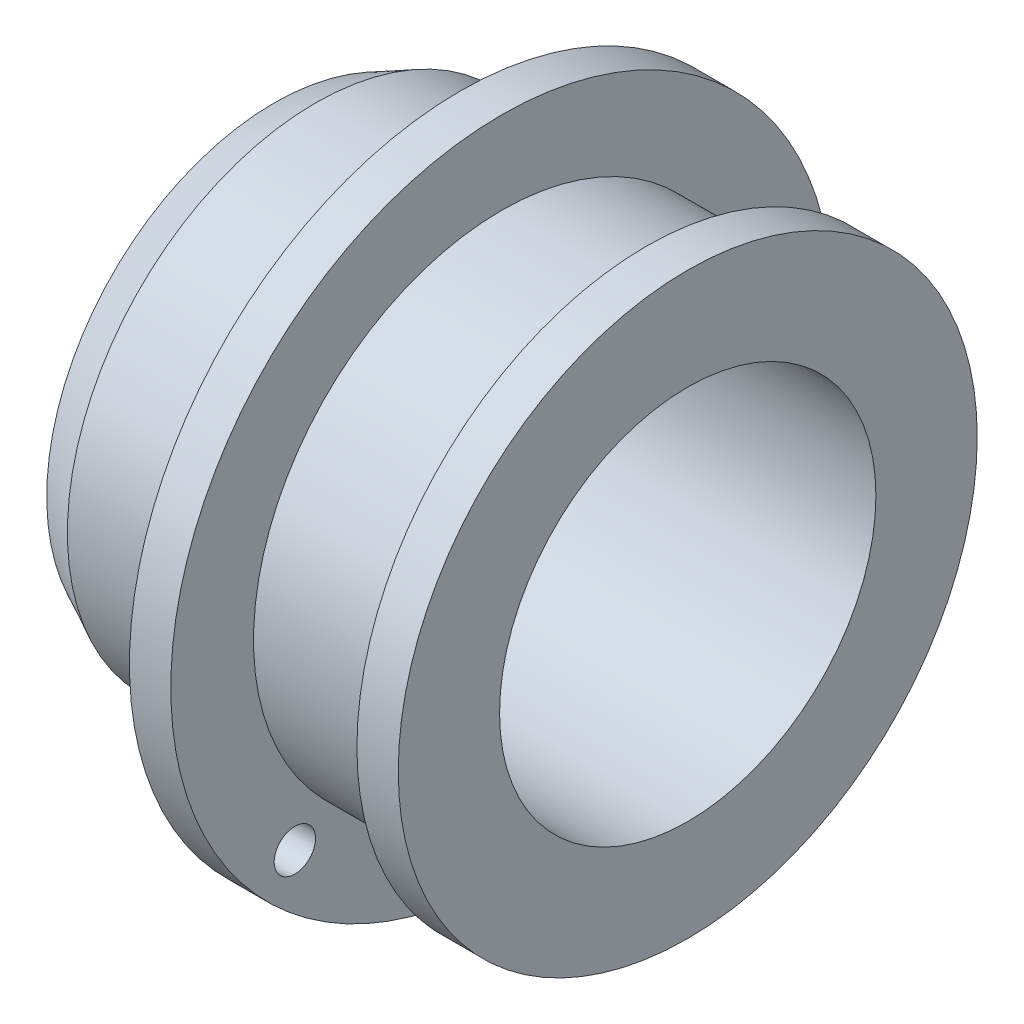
ISO-10303-21;
HEADER;
FILE_DESCRIPTION(('STEP AP214'),'2;1');
FILE_NAME('part.step','',(''),(''),'','','');
FILE_SCHEMA(('AUTOMOTIVE_DESIGN { 1 0 10303 214 1 1 1 1 }'));
ENDSEC;
DATA;
#1=APPLICATION_CONTEXT('core data for automotive mechanical design processes');
#2=APPLICATION_PROTOCOL_DEFINITION('international standard','automotive_design',2000,#1);
#3=PRODUCT_CONTEXT('',#1,'mechanical');
#4=PRODUCT('Part','Part','',(#3));
#5=PRODUCT_RELATED_PRODUCT_CATEGORY('part','',(#4));
#6=PRODUCT_DEFINITION_FORMATION('','',#4);
#7=PRODUCT_DEFINITION_CONTEXT('part definition',#1,'design');
#8=PRODUCT_DEFINITION('design','',#6,#7);
#9=PRODUCT_DEFINITION_SHAPE('','',#8);
#10=(LENGTH_UNIT() NAMED_UNIT(*) SI_UNIT(.MILLI.,.METRE.));
#11=(NAMED_UNIT(*) PLANE_ANGLE_UNIT() SI_UNIT($,.RADIAN.));
#12=(NAMED_UNIT(*) SI_UNIT($,.STERADIAN.) SOLID_ANGLE_UNIT());
#13=UNCERTAINTY_MEASURE_WITH_UNIT(LENGTH_MEASURE(1.E-05),#10,'distance_accuracy_value','');
#14=(GEOMETRIC_REPRESENTATION_CONTEXT(3) GLOBAL_UNCERTAINTY_ASSIGNED_CONTEXT((#13)) GLOBAL_UNIT_ASSIGNED_CONTEXT((#10,
#11,#12)) REPRESENTATION_CONTEXT('',''));
#15=CARTESIAN_POINT('',(0.,0.,0.));
#16=DIRECTION('',(0.,0.,1.));
#17=DIRECTION('',(1.,0.,0.));
#18=AXIS2_PLACEMENT_3D('',#15,#16,#17);
#19=CARTESIAN_POINT('',(0.,0.,0.));
#20=DIRECTION('',(-1.,0.,0.));
#21=DIRECTION('',(0.,-1.,0.));
#22=AXIS2_PLACEMENT_3D('',#19,#20,#21);
#23=PLANE('',#22);
#24=CARTESIAN_POINT('',(0.,0.,0.));
#25=DIRECTION('',(-1.,0.,0.));
#26=DIRECTION('',(0.,-1.,0.));
#27=AXIS2_PLACEMENT_3D('',#24,#25,#26);
#28=CIRCLE('',#27,57.785);
#29=CARTESIAN_POINT('',(0.,-57.785,0.));
#30=VERTEX_POINT('',#29);
#31=EDGE_CURVE('E80',#30,#30,#28,.T.);
#32=ORIENTED_EDGE('',*,*,#31,.F.);
#33=EDGE_LOOP('',(#32));
#34=FACE_BOUND('',#33,.T.);
#35=CARTESIAN_POINT('',(0.,0.,0.));
#36=DIRECTION('',(1.,0.,0.));
#37=DIRECTION('',(0.,1.,0.));
#38=AXIS2_PLACEMENT_3D('',#35,#36,#37);
#39=CIRCLE('',#38,69.85);
#40=CARTESIAN_POINT('',(0.,69.85,0.));
#41=VERTEX_POINT('',#40);
#42=EDGE_CURVE('E10',#41,#41,#39,.T.);
#43=ORIENTED_EDGE('',*,*,#42,.F.);
#44=EDGE_LOOP('',(#43));
#45=FACE_BOUND('',#44,.T.);
#46=ADVANCED_FACE('F34',(#34,#45),#23,.T.);
#47=CARTESIAN_POINT('',(12.7,0.,0.));
#48=DIRECTION('',(1.,0.,0.));
#49=DIRECTION('',(0.,1.,0.));
#50=AXIS2_PLACEMENT_3D('',#47,#48,#49);
#51=CONICAL_SURFACE('',#50,76.2,0.463647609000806);
#52=ORIENTED_EDGE('',*,*,#42,.T.);
#53=EDGE_LOOP('',(#52));
#54=FACE_BOUND('',#53,.T.);
#55=CARTESIAN_POINT('',(12.7,0.,0.));
#56=DIRECTION('',(1.,0.,0.));
#57=DIRECTION('',(0.,1.,0.));
#58=AXIS2_PLACEMENT_3D('',#55,#56,#57);
#59=CIRCLE('',#58,76.2);
#60=CARTESIAN_POINT('',(12.7,76.2,0.));
#61=VERTEX_POINT('',#60);
#62=EDGE_CURVE('E41',#61,#61,#59,.T.);
#63=ORIENTED_EDGE('',*,*,#62,.F.);
#64=EDGE_LOOP('',(#63));
#65=FACE_BOUND('',#64,.T.);
#66=ADVANCED_FACE('F108',(#54,#65),#51,.T.);
#67=CARTESIAN_POINT('',(127.,0.,0.));
#68=DIRECTION('',(1.,0.,0.));
#69=DIRECTION('',(0.,1.,0.));
#70=AXIS2_PLACEMENT_3D('',#67,#68,#69);
#71=CYLINDRICAL_SURFACE('',#70,76.2);
#72=ORIENTED_EDGE('',*,*,#62,.T.);
#73=EDGE_LOOP('',(#72));
#74=FACE_BOUND('',#73,.T.);
#75=CARTESIAN_POINT('',(57.15,0.,0.));
#76=DIRECTION('',(1.,0.,0.));
#77=DIRECTION('',(0.,1.,0.));
#78=AXIS2_PLACEMENT_3D('',#75,#76,#77);
#79=CIRCLE('',#78,76.2);
#80=CARTESIAN_POINT('',(57.15,76.2,0.));
#81=VERTEX_POINT('',#80);
#82=EDGE_CURVE('E45',#81,#81,#79,.T.);
#83=ORIENTED_EDGE('',*,*,#82,.F.);
#84=EDGE_LOOP('',(#83));
#85=FACE_BOUND('',#84,.T.);
#86=ADVANCED_FACE('F113',(#74,#85),#71,.T.);
#87=CARTESIAN_POINT('',(57.15,76.2,0.));
#88=DIRECTION('',(-1.,0.,0.));
#89=DIRECTION('',(0.,-1.,0.));
#90=AXIS2_PLACEMENT_3D('',#87,#88,#89);
#91=PLANE('',#90);
#92=CARTESIAN_POINT('',(57.15,-62.2170394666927,63.5));
#93=DIRECTION('',(-1.,0.,0.));
#94=DIRECTION('',(0.,-1.,0.));
#95=AXIS2_PLACEMENT_3D('',#92,#93,#94);
#96=CIRCLE('',#95,6.35);
#97=CARTESIAN_POINT('',(57.15,-55.8670394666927,63.5));
#98=VERTEX_POINT('',#97);
#99=EDGE_CURVE('E68',#98,#98,#96,.T.);
#100=ORIENTED_EDGE('',*,*,#99,.F.);
#101=EDGE_LOOP('',(#100));
#102=FACE_BOUND('',#101,.T.);
#103=CARTESIAN_POINT('',(57.15,-62.2170394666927,-63.5));
#104=DIRECTION('',(-1.,0.,0.));
#105=DIRECTION('',(0.,-1.,0.));
#106=AXIS2_PLACEMENT_3D('',#103,#104,#105);
#107=CIRCLE('',#106,6.35000000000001);
#108=CARTESIAN_POINT('',(57.15,-55.8670394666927,-63.5));
#109=VERTEX_POINT('',#108);
#110=EDGE_CURVE('E71',#109,#109,#107,.T.);
#111=ORIENTED_EDGE('',*,*,#110,.F.);
#112=EDGE_LOOP('',(#111));
#113=FACE_BOUND('',#112,.T.);
#114=ORIENTED_EDGE('',*,*,#82,.T.);
#115=EDGE_LOOP('',(#114));
#116=FACE_BOUND('',#115,.T.);
#117=CARTESIAN_POINT('',(57.15,0.,0.));
#118=DIRECTION('',(1.,0.,0.));
#119=DIRECTION('',(0.,1.,0.));
#120=AXIS2_PLACEMENT_3D('',#117,#118,#119);
#121=CIRCLE('',#120,101.6);
#122=CARTESIAN_POINT('',(57.15,101.6,0.));
#123=VERTEX_POINT('',#122);
#124=EDGE_CURVE('E50',#123,#123,#121,.T.);
#125=ORIENTED_EDGE('',*,*,#124,.F.);
#126=EDGE_LOOP('',(#125));
#127=FACE_BOUND('',#126,.T.);
#128=ADVANCED_FACE('F118',(#102,#113,#116,#127),#91,.T.);
#129=CARTESIAN_POINT('',(127.,0.,0.));
#130=DIRECTION('',(1.,0.,0.));
#131=DIRECTION('',(0.,1.,0.));
#132=AXIS2_PLACEMENT_3D('',#129,#130,#131);
#133=CYLINDRICAL_SURFACE('',#132,101.6);
#134=ORIENTED_EDGE('',*,*,#124,.T.);
#135=EDGE_LOOP('',(#134));
#136=FACE_BOUND('',#135,.T.);
#137=CARTESIAN_POINT('',(69.85,0.,0.));
#138=DIRECTION('',(1.,0.,0.));
#139=DIRECTION('',(0.,1.,0.));
#140=AXIS2_PLACEMENT_3D('',#137,#138,#139);
#141=CIRCLE('',#140,101.6);
#142=CARTESIAN_POINT('',(69.85,101.6,0.));
#143=VERTEX_POINT('',#142);
#144=EDGE_CURVE('E53',#143,#143,#141,.T.);
#145=ORIENTED_EDGE('',*,*,#144,.F.);
#146=EDGE_LOOP('',(#145));
#147=FACE_BOUND('',#146,.T.);
#148=ADVANCED_FACE('F125',(#136,#147),#133,.T.);
#149=CARTESIAN_POINT('',(69.85,101.6,0.));
#150=DIRECTION('',(1.,0.,0.));
#151=DIRECTION('',(0.,1.,0.));
#152=AXIS2_PLACEMENT_3D('',#149,#150,#151);
#153=PLANE('',#152);
#154=CARTESIAN_POINT('',(69.85,-62.2170394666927,63.5));
#155=DIRECTION('',(1.,0.,0.));
#156=DIRECTION('',(0.,1.,0.));
#157=AXIS2_PLACEMENT_3D('',#154,#155,#156);
#158=CIRCLE('',#157,6.35);
#159=CARTESIAN_POINT('',(69.85,-55.8670394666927,63.5));
#160=VERTEX_POINT('',#159);
#161=EDGE_CURVE('E74',#160,#160,#158,.T.);
#162=ORIENTED_EDGE('',*,*,#161,.F.);
#163=EDGE_LOOP('',(#162));
#164=FACE_BOUND('',#163,.T.);
#165=CARTESIAN_POINT('',(69.85,-62.2170394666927,-63.5));
#166=DIRECTION('',(1.,0.,0.));
#167=DIRECTION('',(0.,1.,0.));
#168=AXIS2_PLACEMENT_3D('',#165,#166,#167);
#169=CIRCLE('',#168,6.35000000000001);
#170=CARTESIAN_POINT('',(69.85,-55.8670394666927,-63.5));
#171=VERTEX_POINT('',#170);
#172=EDGE_CURVE('E75',#171,#171,#169,.T.);
#173=ORIENTED_EDGE('',*,*,#172,.F.);
#174=EDGE_LOOP('',(#173));
#175=FACE_BOUND('',#174,.T.);
#176=ORIENTED_EDGE('',*,*,#144,.T.);
#177=EDGE_LOOP('',(#176));
#178=FACE_BOUND('',#177,.T.);
#179=CARTESIAN_POINT('',(69.85,0.,0.));
#180=DIRECTION('',(1.,0.,0.));
#181=DIRECTION('',(0.,1.,0.));
#182=AXIS2_PLACEMENT_3D('',#179,#180,#181);
#183=CIRCLE('',#182,76.2);
#184=CARTESIAN_POINT('',(69.85,76.2,0.));
#185=VERTEX_POINT('',#184);
#186=EDGE_CURVE('E56',#185,#185,#183,.T.);
#187=ORIENTED_EDGE('',*,*,#186,.F.);
#188=EDGE_LOOP('',(#187));
#189=FACE_BOUND('',#188,.T.);
#190=ADVANCED_FACE('F129',(#164,#175,#178,#189),#153,.T.);
#191=CARTESIAN_POINT('',(127.,0.,0.));
#192=DIRECTION('',(1.,0.,0.));
#193=DIRECTION('',(0.,1.,0.));
#194=AXIS2_PLACEMENT_3D('',#191,#192,#193);
#195=CYLINDRICAL_SURFACE('',#194,76.2);
#196=ORIENTED_EDGE('',*,*,#186,.T.);
#197=EDGE_LOOP('',(#196));
#198=FACE_BOUND('',#197,.T.);
#199=CARTESIAN_POINT('',(114.3,0.,0.));
#200=DIRECTION('',(1.,0.,0.));
#201=DIRECTION('',(0.,1.,0.));
#202=AXIS2_PLACEMENT_3D('',#199,#200,#201);
#203=CIRCLE('',#202,76.2);
#204=CARTESIAN_POINT('',(114.3,76.2,0.));
#205=VERTEX_POINT('',#204);
#206=EDGE_CURVE('E59',#205,#205,#203,.T.);
#207=ORIENTED_EDGE('',*,*,#206,.F.);
#208=EDGE_LOOP('',(#207));
#209=FACE_BOUND('',#208,.T.);
#210=ADVANCED_FACE('F104',(#198,#209),#195,.T.);
#211=CARTESIAN_POINT('',(114.3,76.2,0.));
#212=DIRECTION('',(-1.,0.,0.));
#213=DIRECTION('',(0.,-1.,0.));
#214=AXIS2_PLACEMENT_3D('',#211,#212,#213);
#215=PLANE('',#214);
#216=ORIENTED_EDGE('',*,*,#206,.T.);
#217=EDGE_LOOP('',(#216));
#218=FACE_BOUND('',#217,.T.);
#219=CARTESIAN_POINT('',(114.3,0.,0.));
#220=DIRECTION('',(1.,0.,0.));
#221=DIRECTION('',(0.,1.,0.));
#222=AXIS2_PLACEMENT_3D('',#219,#220,#221);
#223=CIRCLE('',#222,88.9);
#224=CARTESIAN_POINT('',(114.3,88.9,0.));
#225=VERTEX_POINT('',#224);
#226=EDGE_CURVE('E62',#225,#225,#223,.T.);
#227=ORIENTED_EDGE('',*,*,#226,.F.);
#228=EDGE_LOOP('',(#227));
#229=FACE_BOUND('',#228,.T.);
#230=ADVANCED_FACE('F98',(#218,#229),#215,.T.);
#231=CARTESIAN_POINT('',(127.,0.,0.));
#232=DIRECTION('',(1.,0.,0.));
#233=DIRECTION('',(0.,1.,0.));
#234=AXIS2_PLACEMENT_3D('',#231,#232,#233);
#235=CYLINDRICAL_SURFACE('',#234,88.9);
#236=ORIENTED_EDGE('',*,*,#226,.T.);
#237=EDGE_LOOP('',(#236));
#238=FACE_BOUND('',#237,.T.);
#239=CARTESIAN_POINT('',(127.,0.,0.));
#240=DIRECTION('',(1.,0.,0.));
#241=DIRECTION('',(0.,1.,0.));
#242=AXIS2_PLACEMENT_3D('',#239,#240,#241);
#243=CIRCLE('',#242,88.9);
#244=CARTESIAN_POINT('',(127.,88.9,0.));
#245=VERTEX_POINT('',#244);
#246=EDGE_CURVE('E65',#245,#245,#243,.T.);
#247=ORIENTED_EDGE('',*,*,#246,.F.);
#248=EDGE_LOOP('',(#247));
#249=FACE_BOUND('',#248,.T.);
#250=ADVANCED_FACE('F93',(#238,#249),#235,.T.);
#251=CARTESIAN_POINT('',(127.,88.9,0.));
#252=DIRECTION('',(1.,0.,0.));
#253=DIRECTION('',(0.,1.,0.));
#254=AXIS2_PLACEMENT_3D('',#251,#252,#253);
#255=PLANE('',#254);
#256=CARTESIAN_POINT('',(127.,0.,0.));
#257=DIRECTION('',(1.,0.,0.));
#258=DIRECTION('',(0.,1.,0.));
#259=AXIS2_PLACEMENT_3D('',#256,#257,#258);
#260=CIRCLE('',#259,57.785);
#261=CARTESIAN_POINT('',(127.,57.785,0.));
#262=VERTEX_POINT('',#261);
#263=EDGE_CURVE('E37',#262,#262,#260,.T.);
#264=ORIENTED_EDGE('',*,*,#263,.F.);
#265=EDGE_LOOP('',(#264));
#266=FACE_BOUND('',#265,.T.);
#267=ORIENTED_EDGE('',*,*,#246,.T.);
#268=EDGE_LOOP('',(#267));
#269=FACE_BOUND('',#268,.T.);
#270=ADVANCED_FACE('F89',(#266,#269),#255,.T.);
#271=CARTESIAN_POINT('',(-6.34999999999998,-62.2170394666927,-63.5));
#272=DIRECTION('',(1.,0.,0.));
#273=DIRECTION('',(0.,1.,0.));
#274=AXIS2_PLACEMENT_3D('',#271,#272,#273);
#275=CYLINDRICAL_SURFACE('',#274,6.35000000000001);
#276=CARTESIAN_POINT('',(57.15,-55.8670394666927,-63.5));
#277=CARTESIAN_POINT('',(57.2822916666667,-55.8670394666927,-63.5));
#278=CARTESIAN_POINT('',(57.4145833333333,-55.8670394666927,-63.5));
#279=CARTESIAN_POINT('',(57.6791666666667,-55.8670394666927,-63.5));
#280=CARTESIAN_POINT('',(57.8114583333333,-55.8670394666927,-63.5));
#281=CARTESIAN_POINT('',(58.0760416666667,-55.8670394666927,-63.5));
#282=CARTESIAN_POINT('',(58.2083333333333,-55.8670394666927,-63.5));
#283=CARTESIAN_POINT('',(58.4729166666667,-55.8670394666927,-63.5));
#284=CARTESIAN_POINT('',(58.6052083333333,-55.8670394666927,-63.5));
#285=CARTESIAN_POINT('',(58.8697916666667,-55.8670394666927,-63.5));
#286=CARTESIAN_POINT('',(59.0020833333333,-55.8670394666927,-63.5));
#287=CARTESIAN_POINT('',(59.2666666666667,-55.8670394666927,-63.5));
#288=CARTESIAN_POINT('',(59.3989583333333,-55.8670394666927,-63.5));
#289=CARTESIAN_POINT('',(59.6635416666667,-55.8670394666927,-63.5));
#290=CARTESIAN_POINT('',(59.7958333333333,-55.8670394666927,-63.5));
#291=CARTESIAN_POINT('',(60.0604166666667,-55.8670394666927,-63.5));
#292=CARTESIAN_POINT('',(60.1927083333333,-55.8670394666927,-63.5));
#293=CARTESIAN_POINT('',(60.4572916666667,-55.8670394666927,-63.5));
#294=CARTESIAN_POINT('',(60.5895833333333,-55.8670394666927,-63.5));
#295=CARTESIAN_POINT('',(60.8541666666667,-55.8670394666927,-63.5));
#296=CARTESIAN_POINT('',(60.9864583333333,-55.8670394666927,-63.5));
#297=CARTESIAN_POINT('',(61.2510416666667,-55.8670394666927,-63.5));
#298=CARTESIAN_POINT('',(61.3833333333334,-55.8670394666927,-63.5));
#299=CARTESIAN_POINT('',(61.6479166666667,-55.8670394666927,-63.5));
#300=CARTESIAN_POINT('',(61.7802083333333,-55.8670394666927,-63.5));
#301=CARTESIAN_POINT('',(62.0447916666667,-55.8670394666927,-63.5));
#302=CARTESIAN_POINT('',(62.1770833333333,-55.8670394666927,-63.5));
#303=CARTESIAN_POINT('',(62.4416666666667,-55.8670394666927,-63.5));
#304=CARTESIAN_POINT('',(62.5739583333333,-55.8670394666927,-63.5));
#305=CARTESIAN_POINT('',(62.8385416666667,-55.8670394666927,-63.5));
#306=CARTESIAN_POINT('',(62.9708333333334,-55.8670394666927,-63.5));
#307=CARTESIAN_POINT('',(63.2354166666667,-55.8670394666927,-63.5));
#308=CARTESIAN_POINT('',(63.3677083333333,-55.8670394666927,-63.5));
#309=CARTESIAN_POINT('',(63.6322916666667,-55.8670394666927,-63.5));
#310=CARTESIAN_POINT('',(63.7645833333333,-55.8670394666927,-63.5));
#311=CARTESIAN_POINT('',(64.0291666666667,-55.8670394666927,-63.5));
#312=CARTESIAN_POINT('',(64.1614583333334,-55.8670394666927,-63.5));
#313=CARTESIAN_POINT('',(64.4260416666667,-55.8670394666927,-63.5));
#314=CARTESIAN_POINT('',(64.5583333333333,-55.8670394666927,-63.5));
#315=CARTESIAN_POINT('',(64.8229166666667,-55.8670394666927,-63.5));
#316=CARTESIAN_POINT('',(64.9552083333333,-55.8670394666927,-63.5));
#317=CARTESIAN_POINT('',(65.2197916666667,-55.8670394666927,-63.5));
#318=CARTESIAN_POINT('',(65.3520833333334,-55.8670394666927,-63.5));
#319=CARTESIAN_POINT('',(65.6166666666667,-55.8670394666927,-63.5));
#320=CARTESIAN_POINT('',(65.7489583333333,-55.8670394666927,-63.5));
#321=CARTESIAN_POINT('',(66.0135416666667,-55.8670394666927,-63.5));
#322=CARTESIAN_POINT('',(66.1458333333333,-55.8670394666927,-63.5));
#323=CARTESIAN_POINT('',(66.4104166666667,-55.8670394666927,-63.5));
#324=CARTESIAN_POINT('',(66.5427083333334,-55.8670394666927,-63.5));
#325=CARTESIAN_POINT('',(66.8072916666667,-55.8670394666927,-63.5));
#326=CARTESIAN_POINT('',(66.9395833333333,-55.8670394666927,-63.5));
#327=CARTESIAN_POINT('',(67.2041666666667,-55.8670394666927,-63.5));
#328=CARTESIAN_POINT('',(67.3364583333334,-55.8670394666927,-63.5));
#329=CARTESIAN_POINT('',(67.6010416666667,-55.8670394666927,-63.5));
#330=CARTESIAN_POINT('',(67.7333333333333,-55.8670394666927,-63.5));
#331=CARTESIAN_POINT('',(67.9979166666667,-55.8670394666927,-63.5));
#332=CARTESIAN_POINT('',(68.1302083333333,-55.8670394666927,-63.5));
#333=CARTESIAN_POINT('',(68.3947916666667,-55.8670394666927,-63.5));
#334=CARTESIAN_POINT('',(68.5270833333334,-55.8670394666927,-63.5));
#335=CARTESIAN_POINT('',(68.7916666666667,-55.8670394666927,-63.5));
#336=CARTESIAN_POINT('',(68.9239583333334,-55.8670394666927,-63.5));
#337=CARTESIAN_POINT('',(69.1885416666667,-55.8670394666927,-63.5));
#338=CARTESIAN_POINT('',(69.3208333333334,-55.8670394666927,-63.5));
#339=CARTESIAN_POINT('',(69.5854166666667,-55.8670394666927,-63.5));
#340=CARTESIAN_POINT('',(69.7177083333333,-55.8670394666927,-63.5));
#341=CARTESIAN_POINT('',(69.85,-55.8670394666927,-63.5));
#342=B_SPLINE_CURVE_WITH_KNOTS('',3,(#276,#277,#278,#279,#280,#281,#282,#283,#284,#285,#286,
#287,#288,#289,#290,#291,#292,#293,#294,#295,#296,#297,#298,#299,#300,#301,#302,#303,#304,#305,
#306,#307,#308,#309,#310,#311,#312,#313,#314,#315,#316,#317,#318,#319,#320,#321,#322,#323,#324,
#325,#326,#327,#328,#329,#330,#331,#332,#333,#334,#335,#336,#337,#338,#339,#340,#341),
.UNSPECIFIED.,.F.,.F.,(4,2,2,2,2,2,2,2,2,2,2,2,2,2,2,2,2,2,2,2,2,2,2,2,2,2,2,2,2,2,2,2,4),(0.,
0.396875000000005,0.793749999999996,1.190625,1.58750000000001,1.984375,2.38125,2.77812500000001,
3.17500000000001,3.571875,3.96875000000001,4.36562500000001,4.7625,5.15937500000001,
5.55625000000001,5.953125,6.35000000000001,6.74687500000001,7.14375,7.54062500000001,
7.93750000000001,8.334375,8.73125000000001,9.12812500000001,9.52500000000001,9.92187500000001,
10.31875,10.715625,11.1125,11.509375,11.90625,12.303125,12.7),.UNSPECIFIED.);
#343=EDGE_CURVE('BSEAM92',#109,#171,#342,.T.);
#344=ORIENTED_EDGE('',*,*,#110,.T.);
#345=ORIENTED_EDGE('',*,*,#172,.T.);
#346=ORIENTED_EDGE('',*,*,#343,.T.);
#347=ORIENTED_EDGE('',*,*,#343,.F.);
#348=EDGE_LOOP('',(#344,#346,#345,#347));
#349=FACE_BOUND('',#348,.T.);
#350=ADVANCED_FACE('F92',(#349),#275,.F.);
#351=CARTESIAN_POINT('',(-6.34999999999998,-62.2170394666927,63.5));
#352=DIRECTION('',(1.,0.,0.));
#353=DIRECTION('',(0.,1.,0.));
#354=AXIS2_PLACEMENT_3D('',#351,#352,#353);
#355=CYLINDRICAL_SURFACE('',#354,6.35);
#356=CARTESIAN_POINT('',(57.15,-55.8670394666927,63.5));
#357=CARTESIAN_POINT('',(57.2822916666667,-55.8670394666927,63.5));
#358=CARTESIAN_POINT('',(57.4145833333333,-55.8670394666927,63.5));
#359=CARTESIAN_POINT('',(57.6791666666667,-55.8670394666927,63.5));
#360=CARTESIAN_POINT('',(57.8114583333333,-55.8670394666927,63.5));
#361=CARTESIAN_POINT('',(58.0760416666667,-55.8670394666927,63.5));
#362=CARTESIAN_POINT('',(58.2083333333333,-55.8670394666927,63.5));
#363=CARTESIAN_POINT('',(58.4729166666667,-55.8670394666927,63.5));
#364=CARTESIAN_POINT('',(58.6052083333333,-55.8670394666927,63.5));
#365=CARTESIAN_POINT('',(58.8697916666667,-55.8670394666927,63.5));
#366=CARTESIAN_POINT('',(59.0020833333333,-55.8670394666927,63.5));
#367=CARTESIAN_POINT('',(59.2666666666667,-55.8670394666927,63.5));
#368=CARTESIAN_POINT('',(59.3989583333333,-55.8670394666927,63.5));
#369=CARTESIAN_POINT('',(59.6635416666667,-55.8670394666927,63.5));
#370=CARTESIAN_POINT('',(59.7958333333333,-55.8670394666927,63.5));
#371=CARTESIAN_POINT('',(60.0604166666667,-55.8670394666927,63.5));
#372=CARTESIAN_POINT('',(60.1927083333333,-55.8670394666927,63.5));
#373=CARTESIAN_POINT('',(60.4572916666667,-55.8670394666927,63.5));
#374=CARTESIAN_POINT('',(60.5895833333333,-55.8670394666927,63.5));
#375=CARTESIAN_POINT('',(60.8541666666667,-55.8670394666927,63.5));
#376=CARTESIAN_POINT('',(60.9864583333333,-55.8670394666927,63.5));
#377=CARTESIAN_POINT('',(61.2510416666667,-55.8670394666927,63.5));
#378=CARTESIAN_POINT('',(61.3833333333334,-55.8670394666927,63.5));
#379=CARTESIAN_POINT('',(61.6479166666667,-55.8670394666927,63.5));
#380=CARTESIAN_POINT('',(61.7802083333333,-55.8670394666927,63.5));
#381=CARTESIAN_POINT('',(62.0447916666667,-55.8670394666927,63.5));
#382=CARTESIAN_POINT('',(62.1770833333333,-55.8670394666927,63.5));
#383=CARTESIAN_POINT('',(62.4416666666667,-55.8670394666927,63.5));
#384=CARTESIAN_POINT('',(62.5739583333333,-55.8670394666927,63.5));
#385=CARTESIAN_POINT('',(62.8385416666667,-55.8670394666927,63.5));
#386=CARTESIAN_POINT('',(62.9708333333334,-55.8670394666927,63.5));
#387=CARTESIAN_POINT('',(63.2354166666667,-55.8670394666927,63.5));
#388=CARTESIAN_POINT('',(63.3677083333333,-55.8670394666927,63.5));
#389=CARTESIAN_POINT('',(63.6322916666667,-55.8670394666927,63.5));
#390=CARTESIAN_POINT('',(63.7645833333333,-55.8670394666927,63.5));
#391=CARTESIAN_POINT('',(64.0291666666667,-55.8670394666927,63.5));
#392=CARTESIAN_POINT('',(64.1614583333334,-55.8670394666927,63.5));
#393=CARTESIAN_POINT('',(64.4260416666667,-55.8670394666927,63.5));
#394=CARTESIAN_POINT('',(64.5583333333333,-55.8670394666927,63.5));
#395=CARTESIAN_POINT('',(64.8229166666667,-55.8670394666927,63.5));
#396=CARTESIAN_POINT('',(64.9552083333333,-55.8670394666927,63.5));
#397=CARTESIAN_POINT('',(65.2197916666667,-55.8670394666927,63.5));
#398=CARTESIAN_POINT('',(65.3520833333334,-55.8670394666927,63.5));
#399=CARTESIAN_POINT('',(65.6166666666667,-55.8670394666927,63.5));
#400=CARTESIAN_POINT('',(65.7489583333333,-55.8670394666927,63.5));
#401=CARTESIAN_POINT('',(66.0135416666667,-55.8670394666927,63.5));
#402=CARTESIAN_POINT('',(66.1458333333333,-55.8670394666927,63.5));
#403=CARTESIAN_POINT('',(66.4104166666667,-55.8670394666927,63.5));
#404=CARTESIAN_POINT('',(66.5427083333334,-55.8670394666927,63.5));
#405=CARTESIAN_POINT('',(66.8072916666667,-55.8670394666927,63.5));
#406=CARTESIAN_POINT('',(66.9395833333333,-55.8670394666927,63.5));
#407=CARTESIAN_POINT('',(67.2041666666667,-55.8670394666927,63.5));
#408=CARTESIAN_POINT('',(67.3364583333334,-55.8670394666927,63.5));
#409=CARTESIAN_POINT('',(67.6010416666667,-55.8670394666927,63.5));
#410=CARTESIAN_POINT('',(67.7333333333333,-55.8670394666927,63.5));
#411=CARTESIAN_POINT('',(67.9979166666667,-55.8670394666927,63.5));
#412=CARTESIAN_POINT('',(68.1302083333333,-55.8670394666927,63.5));
#413=CARTESIAN_POINT('',(68.3947916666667,-55.8670394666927,63.5));
#414=CARTESIAN_POINT('',(68.5270833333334,-55.8670394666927,63.5));
#415=CARTESIAN_POINT('',(68.7916666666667,-55.8670394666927,63.5));
#416=CARTESIAN_POINT('',(68.9239583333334,-55.8670394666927,63.5));
#417=CARTESIAN_POINT('',(69.1885416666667,-55.8670394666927,63.5));
#418=CARTESIAN_POINT('',(69.3208333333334,-55.8670394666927,63.5));
#419=CARTESIAN_POINT('',(69.5854166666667,-55.8670394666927,63.5));
#420=CARTESIAN_POINT('',(69.7177083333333,-55.8670394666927,63.5));
#421=CARTESIAN_POINT('',(69.85,-55.8670394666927,63.5));
#422=B_SPLINE_CURVE_WITH_KNOTS('',3,(#356,#357,#358,#359,#360,#361,#362,#363,#364,#365,#366,
#367,#368,#369,#370,#371,#372,#373,#374,#375,#376,#377,#378,#379,#380,#381,#382,#383,#384,#385,
#386,#387,#388,#389,#390,#391,#392,#393,#394,#395,#396,#397,#398,#399,#400,#401,#402,#403,#404,
#405,#406,#407,#408,#409,#410,#411,#412,#413,#414,#415,#416,#417,#418,#419,#420,#421),
.UNSPECIFIED.,.F.,.F.,(4,2,2,2,2,2,2,2,2,2,2,2,2,2,2,2,2,2,2,2,2,2,2,2,2,2,2,2,2,2,2,2,4),(0.,
0.396875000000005,0.793749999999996,1.190625,1.58750000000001,1.984375,2.38125,2.77812500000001,
3.17500000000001,3.571875,3.96875000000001,4.36562500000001,4.7625,5.15937500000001,
5.55625000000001,5.953125,6.35000000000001,6.74687500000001,7.14375,7.54062500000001,
7.93750000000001,8.334375,8.73125000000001,9.12812500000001,9.52500000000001,9.92187500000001,
10.31875,10.715625,11.1125,11.509375,11.90625,12.303125,12.7),.UNSPECIFIED.);
#423=EDGE_CURVE('BSEAM177',#98,#160,#422,.T.);
#424=ORIENTED_EDGE('',*,*,#99,.T.);
#425=ORIENTED_EDGE('',*,*,#161,.T.);
#426=ORIENTED_EDGE('',*,*,#423,.T.);
#427=ORIENTED_EDGE('',*,*,#423,.F.);
#428=EDGE_LOOP('',(#424,#426,#425,#427));
#429=FACE_BOUND('',#428,.T.);
#430=ADVANCED_FACE('F177',(#429),#355,.F.);
#431=CARTESIAN_POINT('',(139.7,0.,0.));
#432=DIRECTION('',(-1.,0.,0.));
#433=DIRECTION('',(0.,-1.,0.));
#434=AXIS2_PLACEMENT_3D('',#431,#432,#433);
#435=CYLINDRICAL_SURFACE('',#434,57.785);
#436=ORIENTED_EDGE('',*,*,#263,.T.);
#437=EDGE_LOOP('',(#436));
#438=FACE_BOUND('',#437,.T.);
#439=ORIENTED_EDGE('',*,*,#31,.T.);
#440=EDGE_LOOP('',(#439));
#441=FACE_BOUND('',#440,.T.);
#442=ADVANCED_FACE('F87',(#438,#441),#435,.F.);
#443=CLOSED_SHELL('',(#46,#66,#86,#128,#148,#190,#210,#230,#250,#270,#350,#430,#442));
#444=MANIFOLD_SOLID_BREP('B2',#443);
#445=ADVANCED_BREP_SHAPE_REPRESENTATION('',(#18,#444),#14);
#446=SHAPE_DEFINITION_REPRESENTATION(#9,#445);
ENDSEC;
END-ISO-10303-21;
